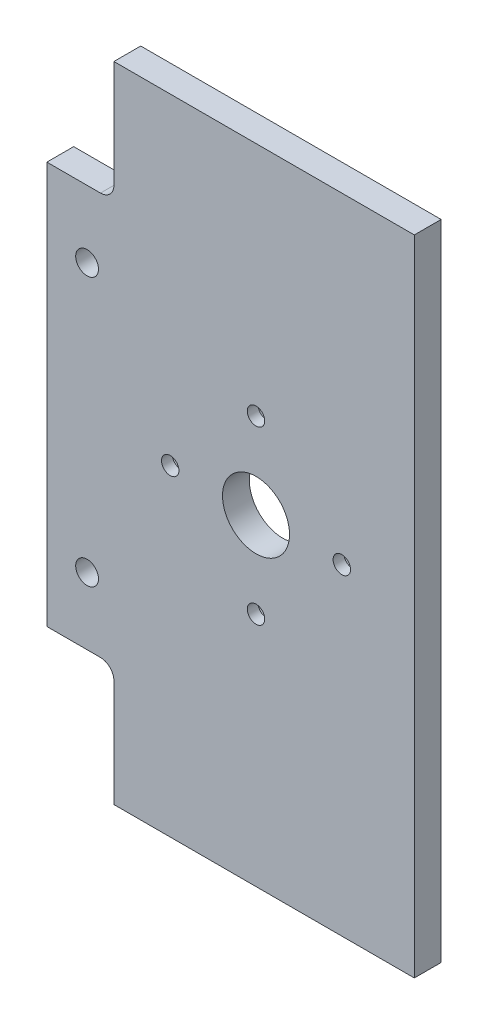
ISO-10303-21;
HEADER;
FILE_DESCRIPTION(('STEP AP214'),'2;1');
FILE_NAME('part.step','',(''),(''),'','','');
FILE_SCHEMA(('AUTOMOTIVE_DESIGN { 1 0 10303 214 1 1 1 1 }'));
ENDSEC;
DATA;
#1=APPLICATION_CONTEXT('core data for automotive mechanical design processes');
#2=APPLICATION_PROTOCOL_DEFINITION('international standard','automotive_design',2000,#1);
#3=PRODUCT_CONTEXT('',#1,'mechanical');
#4=PRODUCT('Part','Part','',(#3));
#5=PRODUCT_RELATED_PRODUCT_CATEGORY('part','',(#4));
#6=PRODUCT_DEFINITION_FORMATION('','',#4);
#7=PRODUCT_DEFINITION_CONTEXT('part definition',#1,'design');
#8=PRODUCT_DEFINITION('design','',#6,#7);
#9=PRODUCT_DEFINITION_SHAPE('','',#8);
#10=(LENGTH_UNIT() NAMED_UNIT(*) SI_UNIT(.MILLI.,.METRE.));
#11=(NAMED_UNIT(*) PLANE_ANGLE_UNIT() SI_UNIT($,.RADIAN.));
#12=(NAMED_UNIT(*) SI_UNIT($,.STERADIAN.) SOLID_ANGLE_UNIT());
#13=UNCERTAINTY_MEASURE_WITH_UNIT(LENGTH_MEASURE(1.E-05),#10,'distance_accuracy_value','');
#14=(GEOMETRIC_REPRESENTATION_CONTEXT(3) GLOBAL_UNCERTAINTY_ASSIGNED_CONTEXT((#13)) GLOBAL_UNIT_ASSIGNED_CONTEXT((#10,
#11,#12)) REPRESENTATION_CONTEXT('',''));
#15=CARTESIAN_POINT('',(0.,0.,0.));
#16=DIRECTION('',(0.,0.,1.));
#17=DIRECTION('',(1.,0.,0.));
#18=AXIS2_PLACEMENT_3D('',#15,#16,#17);
#19=CARTESIAN_POINT('',(-3.31263662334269E-13,-32.,0.));
#20=DIRECTION('',(0.,0.,1.));
#21=DIRECTION('',(1.,0.,0.));
#22=AXIS2_PLACEMENT_3D('',#19,#20,#21);
#23=CYLINDRICAL_SURFACE('',#22,3.25);
#24=CARTESIAN_POINT('',(-3.31263662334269E-13,-32.,10.));
#25=DIRECTION('',(0.,0.,1.));
#26=DIRECTION('',(0.,1.,0.));
#27=AXIS2_PLACEMENT_3D('',#24,#25,#26);
#28=CIRCLE('',#27,3.25);
#29=CARTESIAN_POINT('',(-2.97221699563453E-13,-28.75,10.));
#30=VERTEX_POINT('',#29);
#31=EDGE_CURVE('E194',#30,#30,#28,.T.);
#32=ORIENTED_EDGE('',*,*,#31,.T.);
#33=EDGE_LOOP('',(#32));
#34=FACE_BOUND('',#33,.T.);
#35=CARTESIAN_POINT('',(-3.31263662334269E-13,-32.,6.));
#36=DIRECTION('',(0.,0.,-1.));
#37=DIRECTION('',(-1.,0.,0.));
#38=AXIS2_PLACEMENT_3D('',#35,#36,#37);
#39=CIRCLE('',#38,3.25);
#40=CARTESIAN_POINT('',(-3.25000000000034,-32.,6.));
#41=VERTEX_POINT('',#40);
#42=EDGE_CURVE('E31',#41,#41,#39,.F.);
#43=ORIENTED_EDGE('',*,*,#42,.F.);
#44=EDGE_LOOP('',(#43));
#45=FACE_BOUND('',#44,.T.);
#46=ADVANCED_FACE('F27',(#34,#45),#23,.F.);
#47=CARTESIAN_POINT('',(32.,-2.19536194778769E-13,0.));
#48=DIRECTION('',(0.,0.,1.));
#49=DIRECTION('',(1.,0.,0.));
#50=AXIS2_PLACEMENT_3D('',#47,#48,#49);
#51=CYLINDRICAL_SURFACE('',#50,3.25);
#52=CARTESIAN_POINT('',(32.,-2.19536194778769E-13,10.));
#53=DIRECTION('',(0.,0.,1.));
#54=DIRECTION('',(-1.,0.,0.));
#55=AXIS2_PLACEMENT_3D('',#52,#53,#54);
#56=CIRCLE('',#55,3.25);
#57=CARTESIAN_POINT('',(28.75,-1.96841552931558E-13,10.));
#58=VERTEX_POINT('',#57);
#59=EDGE_CURVE('E217',#58,#58,#56,.T.);
#60=ORIENTED_EDGE('',*,*,#59,.T.);
#61=EDGE_LOOP('',(#60));
#62=FACE_BOUND('',#61,.T.);
#63=CARTESIAN_POINT('',(32.,-2.19536194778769E-13,6.));
#64=DIRECTION('',(0.,0.,-1.));
#65=DIRECTION('',(-1.,0.,0.));
#66=AXIS2_PLACEMENT_3D('',#63,#64,#65);
#67=CIRCLE('',#66,3.25);
#68=CARTESIAN_POINT('',(28.75,-2.19536194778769E-13,6.));
#69=VERTEX_POINT('',#68);
#70=EDGE_CURVE('E196',#69,#69,#67,.F.);
#71=ORIENTED_EDGE('',*,*,#70,.F.);
#72=EDGE_LOOP('',(#71));
#73=FACE_BOUND('',#72,.T.);
#74=ADVANCED_FACE('F252',(#62,#73),#51,.F.);
#75=CARTESIAN_POINT('',(1.07808727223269E-13,32.,0.));
#76=DIRECTION('',(0.,0.,1.));
#77=DIRECTION('',(1.,0.,0.));
#78=AXIS2_PLACEMENT_3D('',#75,#76,#77);
#79=CYLINDRICAL_SURFACE('',#78,3.25);
#80=CARTESIAN_POINT('',(1.07808727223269E-13,32.,10.));
#81=DIRECTION('',(0.,0.,1.));
#82=DIRECTION('',(0.,-1.,0.));
#83=AXIS2_PLACEMENT_3D('',#80,#81,#82);
#84=CIRCLE('',#83,3.25);
#85=CARTESIAN_POINT('',(0.,28.75,10.));
#86=VERTEX_POINT('',#85);
#87=EDGE_CURVE('E220',#86,#86,#84,.T.);
#88=ORIENTED_EDGE('',*,*,#87,.T.);
#89=EDGE_LOOP('',(#88));
#90=FACE_BOUND('',#89,.T.);
#91=CARTESIAN_POINT('',(1.07808727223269E-13,32.,6.));
#92=DIRECTION('',(0.,0.,-1.));
#93=DIRECTION('',(-1.,0.,0.));
#94=AXIS2_PLACEMENT_3D('',#91,#92,#93);
#95=CIRCLE('',#94,3.25);
#96=CARTESIAN_POINT('',(-3.2499999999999,32.,6.));
#97=VERTEX_POINT('',#96);
#98=EDGE_CURVE('E192',#97,#97,#95,.F.);
#99=ORIENTED_EDGE('',*,*,#98,.F.);
#100=EDGE_LOOP('',(#99));
#101=FACE_BOUND('',#100,.T.);
#102=ADVANCED_FACE('F259',(#90,#101),#79,.F.);
#103=CARTESIAN_POINT('',(-32.,0.,0.));
#104=DIRECTION('',(0.,0.,1.));
#105=DIRECTION('',(1.,0.,0.));
#106=AXIS2_PLACEMENT_3D('',#103,#104,#105);
#107=CYLINDRICAL_SURFACE('',#106,3.25);
#108=CARTESIAN_POINT('',(-32.,0.,10.));
#109=DIRECTION('',(0.,0.,1.));
#110=DIRECTION('',(1.,0.,0.));
#111=AXIS2_PLACEMENT_3D('',#108,#109,#110);
#112=CIRCLE('',#111,3.25);
#113=CARTESIAN_POINT('',(-28.75,0.,10.));
#114=VERTEX_POINT('',#113);
#115=EDGE_CURVE('E190',#114,#114,#112,.T.);
#116=ORIENTED_EDGE('',*,*,#115,.T.);
#117=EDGE_LOOP('',(#116));
#118=FACE_BOUND('',#117,.T.);
#119=CARTESIAN_POINT('',(-32.,0.,6.));
#120=DIRECTION('',(0.,0.,-1.));
#121=DIRECTION('',(-1.,0.,0.));
#122=AXIS2_PLACEMENT_3D('',#119,#120,#121);
#123=CIRCLE('',#122,3.25);
#124=CARTESIAN_POINT('',(-35.25,0.,6.));
#125=VERTEX_POINT('',#124);
#126=EDGE_CURVE('E187',#125,#125,#123,.F.);
#127=ORIENTED_EDGE('',*,*,#126,.F.);
#128=EDGE_LOOP('',(#127));
#129=FACE_BOUND('',#128,.T.);
#130=ADVANCED_FACE('F268',(#118,#129),#107,.F.);
#131=CARTESIAN_POINT('',(-58.,-80.,10.));
#132=DIRECTION('',(0.,0.,1.));
#133=DIRECTION('',(1.,0.,0.));
#134=AXIS2_PLACEMENT_3D('',#131,#132,#133);
#135=PLANE('',#134);
#136=CARTESIAN_POINT('',(-63.,-50.,10.));
#137=DIRECTION('',(0.,0.,1.));
#138=DIRECTION('',(1.,0.,0.));
#139=AXIS2_PLACEMENT_3D('',#136,#137,#138);
#140=CIRCLE('',#139,4.25000000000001);
#141=CARTESIAN_POINT('',(-58.75,-50.,10.));
#142=VERTEX_POINT('',#141);
#143=EDGE_CURVE('E402',#142,#142,#140,.T.);
#144=ORIENTED_EDGE('',*,*,#143,.F.);
#145=EDGE_LOOP('',(#144));
#146=FACE_BOUND('',#145,.T.);
#147=CARTESIAN_POINT('',(-63.,50.,10.));
#148=DIRECTION('',(0.,0.,1.));
#149=DIRECTION('',(1.,0.,0.));
#150=AXIS2_PLACEMENT_3D('',#147,#148,#149);
#151=CIRCLE('',#150,4.25000000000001);
#152=CARTESIAN_POINT('',(-58.75,50.,10.));
#153=VERTEX_POINT('',#152);
#154=EDGE_CURVE('E404',#153,#153,#151,.T.);
#155=ORIENTED_EDGE('',*,*,#154,.F.);
#156=EDGE_LOOP('',(#155));
#157=FACE_BOUND('',#156,.T.);
#158=ORIENTED_EDGE('',*,*,#31,.F.);
#159=EDGE_LOOP('',(#158));
#160=FACE_BOUND('',#159,.T.);
#161=ORIENTED_EDGE('',*,*,#59,.F.);
#162=EDGE_LOOP('',(#161));
#163=FACE_BOUND('',#162,.T.);
#164=ORIENTED_EDGE('',*,*,#87,.F.);
#165=EDGE_LOOP('',(#164));
#166=FACE_BOUND('',#165,.T.);
#167=ORIENTED_EDGE('',*,*,#115,.F.);
#168=EDGE_LOOP('',(#167));
#169=FACE_BOUND('',#168,.T.);
#170=DIRECTION('',(0.,-1.,0.));
#171=VECTOR('',#170,1.);
#172=CARTESIAN_POINT('',(-53.,-120.,10.));
#173=LINE('',#172,#171);
#174=CARTESIAN_POINT('',(-53.,-80.,10.));
#175=VERTEX_POINT('',#174);
#176=CARTESIAN_POINT('',(-53.,-120.,10.));
#177=VERTEX_POINT('',#176);
#178=EDGE_CURVE('E147',#175,#177,#173,.T.);
#179=ORIENTED_EDGE('',*,*,#178,.T.);
#180=DIRECTION('',(1.,0.,0.));
#181=VECTOR('',#180,1.);
#182=CARTESIAN_POINT('',(-53.,-120.,10.));
#183=LINE('',#182,#181);
#184=CARTESIAN_POINT('',(59.0364270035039,-120.,10.));
#185=VERTEX_POINT('',#184);
#186=EDGE_CURVE('E120',#177,#185,#183,.T.);
#187=ORIENTED_EDGE('',*,*,#186,.T.);
#188=DIRECTION('',(0.,1.,0.));
#189=VECTOR('',#188,1.);
#190=CARTESIAN_POINT('',(59.0364270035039,120.,10.));
#191=LINE('',#190,#189);
#192=CARTESIAN_POINT('',(59.0364270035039,120.,10.));
#193=VERTEX_POINT('',#192);
#194=EDGE_CURVE('E150',#185,#193,#191,.T.);
#195=ORIENTED_EDGE('',*,*,#194,.T.);
#196=DIRECTION('',(-1.,0.,0.));
#197=VECTOR('',#196,1.);
#198=CARTESIAN_POINT('',(-53.,120.,10.));
#199=LINE('',#198,#197);
#200=CARTESIAN_POINT('',(-53.,120.,10.));
#201=VERTEX_POINT('',#200);
#202=EDGE_CURVE('E152',#193,#201,#199,.T.);
#203=ORIENTED_EDGE('',*,*,#202,.T.);
#204=DIRECTION('',(0.,-1.,0.));
#205=VECTOR('',#204,1.);
#206=CARTESIAN_POINT('',(-53.,120.,10.));
#207=LINE('',#206,#205);
#208=CARTESIAN_POINT('',(-53.,80.,10.));
#209=VERTEX_POINT('',#208);
#210=EDGE_CURVE('E154',#201,#209,#207,.T.);
#211=ORIENTED_EDGE('',*,*,#210,.T.);
#212=CARTESIAN_POINT('',(-58.,80.,10.));
#213=DIRECTION('',(0.,0.,-1.));
#214=DIRECTION('',(-1.,0.,0.));
#215=AXIS2_PLACEMENT_3D('',#212,#213,#214);
#216=CIRCLE('',#215,5.);
#217=CARTESIAN_POINT('',(-58.,75.,10.));
#218=VERTEX_POINT('',#217);
#219=EDGE_CURVE('E156',#209,#218,#216,.T.);
#220=ORIENTED_EDGE('',*,*,#219,.T.);
#221=DIRECTION('',(-1.,0.,0.));
#222=VECTOR('',#221,1.);
#223=CARTESIAN_POINT('',(-78.,75.,10.));
#224=LINE('',#223,#222);
#225=CARTESIAN_POINT('',(-78.,75.,10.));
#226=VERTEX_POINT('',#225);
#227=EDGE_CURVE('E158',#218,#226,#224,.T.);
#228=ORIENTED_EDGE('',*,*,#227,.T.);
#229=DIRECTION('',(0.,-1.,0.));
#230=VECTOR('',#229,1.);
#231=CARTESIAN_POINT('',(-78.,75.,10.));
#232=LINE('',#231,#230);
#233=CARTESIAN_POINT('',(-78.,-75.,10.));
#234=VERTEX_POINT('',#233);
#235=EDGE_CURVE('E160',#226,#234,#232,.T.);
#236=ORIENTED_EDGE('',*,*,#235,.T.);
#237=DIRECTION('',(1.,0.,0.));
#238=VECTOR('',#237,1.);
#239=CARTESIAN_POINT('',(-78.,-75.,10.));
#240=LINE('',#239,#238);
#241=CARTESIAN_POINT('',(-58.,-75.,10.));
#242=VERTEX_POINT('',#241);
#243=EDGE_CURVE('E49',#234,#242,#240,.T.);
#244=ORIENTED_EDGE('',*,*,#243,.T.);
#245=CARTESIAN_POINT('',(-58.,-80.,10.));
#246=DIRECTION('',(0.,0.,-1.));
#247=DIRECTION('',(1.,0.,0.));
#248=AXIS2_PLACEMENT_3D('',#245,#246,#247);
#249=CIRCLE('',#248,5.);
#250=EDGE_CURVE('E44',#242,#175,#249,.T.);
#251=ORIENTED_EDGE('',*,*,#250,.T.);
#252=EDGE_LOOP('',(#179,#187,#195,#203,#211,#220,#228,#236,#244,#251));
#253=FACE_BOUND('',#252,.T.);
#254=CARTESIAN_POINT('',(0.,0.,10.));
#255=DIRECTION('',(0.,0.,1.));
#256=DIRECTION('',(1.,0.,0.));
#257=AXIS2_PLACEMENT_3D('',#254,#255,#256);
#258=CIRCLE('',#257,12.5);
#259=CARTESIAN_POINT('',(12.5,0.,10.));
#260=VERTEX_POINT('',#259);
#261=EDGE_CURVE('E125',#260,#260,#258,.T.);
#262=ORIENTED_EDGE('',*,*,#261,.F.);
#263=EDGE_LOOP('',(#262));
#264=FACE_BOUND('',#263,.T.);
#265=ADVANCED_FACE('F273',(#146,#157,#160,#163,#166,#169,#253,#264),#135,.T.);
#266=CARTESIAN_POINT('',(-58.,-80.,0.));
#267=DIRECTION('',(0.,0.,1.));
#268=DIRECTION('',(1.,0.,0.));
#269=AXIS2_PLACEMENT_3D('',#266,#267,#268);
#270=PLANE('',#269);
#271=CARTESIAN_POINT('',(-63.,-50.,0.));
#272=DIRECTION('',(0.,0.,1.));
#273=DIRECTION('',(1.,0.,0.));
#274=AXIS2_PLACEMENT_3D('',#271,#272,#273);
#275=CIRCLE('',#274,4.25000000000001);
#276=CARTESIAN_POINT('',(-58.75,-50.,0.));
#277=VERTEX_POINT('',#276);
#278=EDGE_CURVE('E347',#277,#277,#275,.T.);
#279=ORIENTED_EDGE('',*,*,#278,.T.);
#280=EDGE_LOOP('',(#279));
#281=FACE_BOUND('',#280,.T.);
#282=CARTESIAN_POINT('',(-63.,50.,0.));
#283=DIRECTION('',(0.,0.,1.));
#284=DIRECTION('',(1.,0.,0.));
#285=AXIS2_PLACEMENT_3D('',#282,#283,#284);
#286=CIRCLE('',#285,4.25000000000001);
#287=CARTESIAN_POINT('',(-58.75,50.,0.));
#288=VERTEX_POINT('',#287);
#289=EDGE_CURVE('E351',#288,#288,#286,.T.);
#290=ORIENTED_EDGE('',*,*,#289,.T.);
#291=EDGE_LOOP('',(#290));
#292=FACE_BOUND('',#291,.T.);
#293=CARTESIAN_POINT('',(-3.31263662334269E-13,-32.,0.));
#294=DIRECTION('',(0.,0.,-1.));
#295=DIRECTION('',(0.,-1.,0.));
#296=AXIS2_PLACEMENT_3D('',#293,#294,#295);
#297=CIRCLE('',#296,6.50000000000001);
#298=CARTESIAN_POINT('',(-3.99347587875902E-13,-38.5,0.));
#299=VERTEX_POINT('',#298);
#300=EDGE_CURVE('E355',#299,#299,#297,.T.);
#301=ORIENTED_EDGE('',*,*,#300,.F.);
#302=EDGE_LOOP('',(#301));
#303=FACE_BOUND('',#302,.T.);
#304=CARTESIAN_POINT('',(32.,-2.19536194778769E-13,0.));
#305=DIRECTION('',(0.,0.,-1.));
#306=DIRECTION('',(1.,0.,0.));
#307=AXIS2_PLACEMENT_3D('',#304,#305,#306);
#308=CIRCLE('',#307,6.50000000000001);
#309=CARTESIAN_POINT('',(38.5,-2.64925478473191E-13,0.));
#310=VERTEX_POINT('',#309);
#311=EDGE_CURVE('E205',#310,#310,#308,.T.);
#312=ORIENTED_EDGE('',*,*,#311,.F.);
#313=EDGE_LOOP('',(#312));
#314=FACE_BOUND('',#313,.T.);
#315=CARTESIAN_POINT('',(1.07808727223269E-13,32.,0.));
#316=DIRECTION('',(0.,0.,-1.));
#317=DIRECTION('',(0.,1.,0.));
#318=AXIS2_PLACEMENT_3D('',#315,#316,#317);
#319=CIRCLE('',#318,6.50000000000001);
#320=CARTESIAN_POINT('',(1.3050336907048E-13,38.5,0.));
#321=VERTEX_POINT('',#320);
#322=EDGE_CURVE('E198',#321,#321,#319,.T.);
#323=ORIENTED_EDGE('',*,*,#322,.F.);
#324=EDGE_LOOP('',(#323));
#325=FACE_BOUND('',#324,.T.);
#326=CARTESIAN_POINT('',(-32.,0.,0.));
#327=DIRECTION('',(0.,0.,-1.));
#328=DIRECTION('',(-1.,0.,0.));
#329=AXIS2_PLACEMENT_3D('',#326,#327,#328);
#330=CIRCLE('',#329,6.50000000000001);
#331=CARTESIAN_POINT('',(-38.5,0.,0.));
#332=VERTEX_POINT('',#331);
#333=EDGE_CURVE('E223',#332,#332,#330,.T.);
#334=ORIENTED_EDGE('',*,*,#333,.F.);
#335=EDGE_LOOP('',(#334));
#336=FACE_BOUND('',#335,.T.);
#337=DIRECTION('',(0.,-1.,0.));
#338=VECTOR('',#337,1.);
#339=CARTESIAN_POINT('',(-53.,-120.,0.));
#340=LINE('',#339,#338);
#341=CARTESIAN_POINT('',(-53.,-80.,0.));
#342=VERTEX_POINT('',#341);
#343=CARTESIAN_POINT('',(-53.,-120.,0.));
#344=VERTEX_POINT('',#343);
#345=EDGE_CURVE('E111',#342,#344,#340,.T.);
#346=ORIENTED_EDGE('',*,*,#345,.F.);
#347=CARTESIAN_POINT('',(-58.,-80.,0.));
#348=DIRECTION('',(0.,0.,-1.));
#349=DIRECTION('',(1.,0.,0.));
#350=AXIS2_PLACEMENT_3D('',#347,#348,#349);
#351=CIRCLE('',#350,5.);
#352=CARTESIAN_POINT('',(-58.,-75.,0.));
#353=VERTEX_POINT('',#352);
#354=EDGE_CURVE('E145',#353,#342,#351,.T.);
#355=ORIENTED_EDGE('',*,*,#354,.F.);
#356=DIRECTION('',(1.,0.,0.));
#357=VECTOR('',#356,1.);
#358=CARTESIAN_POINT('',(-78.,-75.,0.));
#359=LINE('',#358,#357);
#360=CARTESIAN_POINT('',(-78.,-75.,0.));
#361=VERTEX_POINT('',#360);
#362=EDGE_CURVE('E143',#361,#353,#359,.T.);
#363=ORIENTED_EDGE('',*,*,#362,.F.);
#364=DIRECTION('',(0.,-1.,0.));
#365=VECTOR('',#364,1.);
#366=CARTESIAN_POINT('',(-78.,75.,0.));
#367=LINE('',#366,#365);
#368=CARTESIAN_POINT('',(-78.,75.,0.));
#369=VERTEX_POINT('',#368);
#370=EDGE_CURVE('E141',#369,#361,#367,.T.);
#371=ORIENTED_EDGE('',*,*,#370,.F.);
#372=DIRECTION('',(-1.,0.,0.));
#373=VECTOR('',#372,1.);
#374=CARTESIAN_POINT('',(-78.,75.,0.));
#375=LINE('',#374,#373);
#376=CARTESIAN_POINT('',(-58.,75.,0.));
#377=VERTEX_POINT('',#376);
#378=EDGE_CURVE('E139',#377,#369,#375,.T.);
#379=ORIENTED_EDGE('',*,*,#378,.F.);
#380=CARTESIAN_POINT('',(-58.,80.,0.));
#381=DIRECTION('',(0.,0.,-1.));
#382=DIRECTION('',(-1.,0.,0.));
#383=AXIS2_PLACEMENT_3D('',#380,#381,#382);
#384=CIRCLE('',#383,5.);
#385=CARTESIAN_POINT('',(-53.,80.,0.));
#386=VERTEX_POINT('',#385);
#387=EDGE_CURVE('E137',#386,#377,#384,.T.);
#388=ORIENTED_EDGE('',*,*,#387,.F.);
#389=DIRECTION('',(0.,-1.,0.));
#390=VECTOR('',#389,1.);
#391=CARTESIAN_POINT('',(-53.,120.,0.));
#392=LINE('',#391,#390);
#393=CARTESIAN_POINT('',(-53.,120.,0.));
#394=VERTEX_POINT('',#393);
#395=EDGE_CURVE('E135',#394,#386,#392,.T.);
#396=ORIENTED_EDGE('',*,*,#395,.F.);
#397=DIRECTION('',(-1.,0.,0.));
#398=VECTOR('',#397,1.);
#399=CARTESIAN_POINT('',(-53.,120.,0.));
#400=LINE('',#399,#398);
#401=CARTESIAN_POINT('',(59.0364270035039,120.,0.));
#402=VERTEX_POINT('',#401);
#403=EDGE_CURVE('E133',#402,#394,#400,.T.);
#404=ORIENTED_EDGE('',*,*,#403,.F.);
#405=DIRECTION('',(0.,1.,0.));
#406=VECTOR('',#405,1.);
#407=CARTESIAN_POINT('',(59.0364270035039,120.,0.));
#408=LINE('',#407,#406);
#409=CARTESIAN_POINT('',(59.0364270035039,-120.,0.));
#410=VERTEX_POINT('',#409);
#411=EDGE_CURVE('E113',#410,#402,#408,.T.);
#412=ORIENTED_EDGE('',*,*,#411,.F.);
#413=DIRECTION('',(1.,0.,0.));
#414=VECTOR('',#413,1.);
#415=CARTESIAN_POINT('',(-53.,-120.,0.));
#416=LINE('',#415,#414);
#417=EDGE_CURVE('E106',#344,#410,#416,.T.);
#418=ORIENTED_EDGE('',*,*,#417,.F.);
#419=EDGE_LOOP('',(#346,#355,#363,#371,#379,#388,#396,#404,#412,#418));
#420=FACE_BOUND('',#419,.T.);
#421=CARTESIAN_POINT('',(0.,0.,0.));
#422=DIRECTION('',(0.,0.,1.));
#423=DIRECTION('',(1.,0.,0.));
#424=AXIS2_PLACEMENT_3D('',#421,#422,#423);
#425=CIRCLE('',#424,12.5);
#426=CARTESIAN_POINT('',(12.5,0.,0.));
#427=VERTEX_POINT('',#426);
#428=EDGE_CURVE('E128',#427,#427,#425,.T.);
#429=ORIENTED_EDGE('',*,*,#428,.T.);
#430=EDGE_LOOP('',(#429));
#431=FACE_BOUND('',#430,.T.);
#432=ADVANCED_FACE('F107',(#281,#292,#303,#314,#325,#336,#420,#431),#270,.F.);
#433=CARTESIAN_POINT('',(-53.,-120.,10.));
#434=DIRECTION('',(1.,0.,0.));
#435=DIRECTION('',(0.,1.,0.));
#436=AXIS2_PLACEMENT_3D('',#433,#434,#435);
#437=PLANE('',#436);
#438=ORIENTED_EDGE('',*,*,#345,.T.);
#439=DIRECTION('',(0.,0.,-1.));
#440=VECTOR('',#439,1.);
#441=CARTESIAN_POINT('',(-53.,-120.,10.));
#442=LINE('',#441,#440);
#443=EDGE_CURVE('E11',#177,#344,#442,.T.);
#444=ORIENTED_EDGE('',*,*,#443,.F.);
#445=ORIENTED_EDGE('',*,*,#178,.F.);
#446=DIRECTION('',(0.,0.,-1.));
#447=VECTOR('',#446,1.);
#448=CARTESIAN_POINT('',(-53.,-80.,10.));
#449=LINE('',#448,#447);
#450=EDGE_CURVE('E124',#175,#342,#449,.T.);
#451=ORIENTED_EDGE('',*,*,#450,.T.);
#452=EDGE_LOOP('',(#438,#444,#445,#451));
#453=FACE_BOUND('',#452,.T.);
#454=ADVANCED_FACE('F29',(#453),#437,.F.);
#455=CARTESIAN_POINT('',(-53.,-120.,10.));
#456=DIRECTION('',(0.,1.,0.));
#457=DIRECTION('',(0.,0.,1.));
#458=AXIS2_PLACEMENT_3D('',#455,#456,#457);
#459=PLANE('',#458);
#460=ORIENTED_EDGE('',*,*,#417,.T.);
#461=DIRECTION('',(0.,0.,-1.));
#462=VECTOR('',#461,1.);
#463=CARTESIAN_POINT('',(59.0364270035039,-120.,10.));
#464=LINE('',#463,#462);
#465=EDGE_CURVE('E36',#185,#410,#464,.T.);
#466=ORIENTED_EDGE('',*,*,#465,.F.);
#467=ORIENTED_EDGE('',*,*,#186,.F.);
#468=ORIENTED_EDGE('',*,*,#443,.T.);
#469=EDGE_LOOP('',(#460,#466,#467,#468));
#470=FACE_BOUND('',#469,.T.);
#471=ADVANCED_FACE('F119',(#470),#459,.F.);
#472=CARTESIAN_POINT('',(59.0364270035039,120.,10.));
#473=DIRECTION('',(-1.,0.,0.));
#474=DIRECTION('',(0.,0.,1.));
#475=AXIS2_PLACEMENT_3D('',#472,#473,#474);
#476=PLANE('',#475);
#477=ORIENTED_EDGE('',*,*,#411,.T.);
#478=DIRECTION('',(0.,0.,-1.));
#479=VECTOR('',#478,1.);
#480=CARTESIAN_POINT('',(59.0364270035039,120.,10.));
#481=LINE('',#480,#479);
#482=EDGE_CURVE('E183',#193,#402,#481,.T.);
#483=ORIENTED_EDGE('',*,*,#482,.F.);
#484=ORIENTED_EDGE('',*,*,#194,.F.);
#485=ORIENTED_EDGE('',*,*,#465,.T.);
#486=EDGE_LOOP('',(#477,#483,#484,#485));
#487=FACE_BOUND('',#486,.T.);
#488=ADVANCED_FACE('F290',(#487),#476,.F.);
#489=CARTESIAN_POINT('',(-53.,120.,10.));
#490=DIRECTION('',(0.,-1.,0.));
#491=DIRECTION('',(0.,0.,-1.));
#492=AXIS2_PLACEMENT_3D('',#489,#490,#491);
#493=PLANE('',#492);
#494=ORIENTED_EDGE('',*,*,#403,.T.);
#495=DIRECTION('',(0.,0.,-1.));
#496=VECTOR('',#495,1.);
#497=CARTESIAN_POINT('',(-53.,120.,10.));
#498=LINE('',#497,#496);
#499=EDGE_CURVE('E180',#201,#394,#498,.T.);
#500=ORIENTED_EDGE('',*,*,#499,.F.);
#501=ORIENTED_EDGE('',*,*,#202,.F.);
#502=ORIENTED_EDGE('',*,*,#482,.T.);
#503=EDGE_LOOP('',(#494,#500,#501,#502));
#504=FACE_BOUND('',#503,.T.);
#505=ADVANCED_FACE('F294',(#504),#493,.F.);
#506=CARTESIAN_POINT('',(-53.,120.,10.));
#507=DIRECTION('',(1.,0.,0.));
#508=DIRECTION('',(0.,1.,0.));
#509=AXIS2_PLACEMENT_3D('',#506,#507,#508);
#510=PLANE('',#509);
#511=ORIENTED_EDGE('',*,*,#395,.T.);
#512=DIRECTION('',(0.,0.,-1.));
#513=VECTOR('',#512,1.);
#514=CARTESIAN_POINT('',(-53.,80.,10.));
#515=LINE('',#514,#513);
#516=EDGE_CURVE('E177',#209,#386,#515,.T.);
#517=ORIENTED_EDGE('',*,*,#516,.F.);
#518=ORIENTED_EDGE('',*,*,#210,.F.);
#519=ORIENTED_EDGE('',*,*,#499,.T.);
#520=EDGE_LOOP('',(#511,#517,#518,#519));
#521=FACE_BOUND('',#520,.T.);
#522=ADVANCED_FACE('F300',(#521),#510,.F.);
#523=CARTESIAN_POINT('',(-58.,80.,10.));
#524=DIRECTION('',(0.,0.,-1.));
#525=DIRECTION('',(-1.,0.,0.));
#526=AXIS2_PLACEMENT_3D('',#523,#524,#525);
#527=CYLINDRICAL_SURFACE('',#526,5.);
#528=ORIENTED_EDGE('',*,*,#387,.T.);
#529=DIRECTION('',(0.,0.,-1.));
#530=VECTOR('',#529,1.);
#531=CARTESIAN_POINT('',(-58.,75.,10.));
#532=LINE('',#531,#530);
#533=EDGE_CURVE('E174',#218,#377,#532,.T.);
#534=ORIENTED_EDGE('',*,*,#533,.F.);
#535=ORIENTED_EDGE('',*,*,#219,.F.);
#536=ORIENTED_EDGE('',*,*,#516,.T.);
#537=EDGE_LOOP('',(#528,#534,#535,#536));
#538=FACE_BOUND('',#537,.T.);
#539=ADVANCED_FACE('F304',(#538),#527,.F.);
#540=CARTESIAN_POINT('',(-78.,75.,10.));
#541=DIRECTION('',(0.,-1.,0.));
#542=DIRECTION('',(0.,0.,-1.));
#543=AXIS2_PLACEMENT_3D('',#540,#541,#542);
#544=PLANE('',#543);
#545=ORIENTED_EDGE('',*,*,#378,.T.);
#546=DIRECTION('',(0.,0.,-1.));
#547=VECTOR('',#546,1.);
#548=CARTESIAN_POINT('',(-78.,75.,10.));
#549=LINE('',#548,#547);
#550=EDGE_CURVE('E171',#226,#369,#549,.T.);
#551=ORIENTED_EDGE('',*,*,#550,.F.);
#552=ORIENTED_EDGE('',*,*,#227,.F.);
#553=ORIENTED_EDGE('',*,*,#533,.T.);
#554=EDGE_LOOP('',(#545,#551,#552,#553));
#555=FACE_BOUND('',#554,.T.);
#556=ADVANCED_FACE('F309',(#555),#544,.F.);
#557=CARTESIAN_POINT('',(-78.,75.,10.));
#558=DIRECTION('',(1.,0.,0.));
#559=DIRECTION('',(0.,0.,-1.));
#560=AXIS2_PLACEMENT_3D('',#557,#558,#559);
#561=PLANE('',#560);
#562=ORIENTED_EDGE('',*,*,#370,.T.);
#563=DIRECTION('',(0.,0.,-1.));
#564=VECTOR('',#563,1.);
#565=CARTESIAN_POINT('',(-78.,-75.,10.));
#566=LINE('',#565,#564);
#567=EDGE_CURVE('E168',#234,#361,#566,.T.);
#568=ORIENTED_EDGE('',*,*,#567,.F.);
#569=ORIENTED_EDGE('',*,*,#235,.F.);
#570=ORIENTED_EDGE('',*,*,#550,.T.);
#571=EDGE_LOOP('',(#562,#568,#569,#570));
#572=FACE_BOUND('',#571,.T.);
#573=ADVANCED_FACE('F313',(#572),#561,.F.);
#574=CARTESIAN_POINT('',(-78.,-75.,10.));
#575=DIRECTION('',(0.,1.,0.));
#576=DIRECTION('',(0.,0.,1.));
#577=AXIS2_PLACEMENT_3D('',#574,#575,#576);
#578=PLANE('',#577);
#579=ORIENTED_EDGE('',*,*,#362,.T.);
#580=DIRECTION('',(0.,0.,-1.));
#581=VECTOR('',#580,1.);
#582=CARTESIAN_POINT('',(-58.,-75.,10.));
#583=LINE('',#582,#581);
#584=EDGE_CURVE('E165',#242,#353,#583,.T.);
#585=ORIENTED_EDGE('',*,*,#584,.F.);
#586=ORIENTED_EDGE('',*,*,#243,.F.);
#587=ORIENTED_EDGE('',*,*,#567,.T.);
#588=EDGE_LOOP('',(#579,#585,#586,#587));
#589=FACE_BOUND('',#588,.T.);
#590=ADVANCED_FACE('F246',(#589),#578,.F.);
#591=CARTESIAN_POINT('',(-58.,-80.,10.));
#592=DIRECTION('',(0.,0.,-1.));
#593=DIRECTION('',(-1.,0.,0.));
#594=AXIS2_PLACEMENT_3D('',#591,#592,#593);
#595=CYLINDRICAL_SURFACE('',#594,5.);
#596=ORIENTED_EDGE('',*,*,#354,.T.);
#597=ORIENTED_EDGE('',*,*,#450,.F.);
#598=ORIENTED_EDGE('',*,*,#250,.F.);
#599=ORIENTED_EDGE('',*,*,#584,.T.);
#600=EDGE_LOOP('',(#596,#597,#598,#599));
#601=FACE_BOUND('',#600,.T.);
#602=ADVANCED_FACE('F235',(#601),#595,.F.);
#603=CARTESIAN_POINT('',(0.,0.,10.));
#604=DIRECTION('',(0.,0.,-1.));
#605=DIRECTION('',(-1.,0.,0.));
#606=AXIS2_PLACEMENT_3D('',#603,#604,#605);
#607=CYLINDRICAL_SURFACE('',#606,12.5);
#608=ORIENTED_EDGE('',*,*,#261,.T.);
#609=EDGE_LOOP('',(#608));
#610=FACE_BOUND('',#609,.T.);
#611=ORIENTED_EDGE('',*,*,#428,.F.);
#612=EDGE_LOOP('',(#611));
#613=FACE_BOUND('',#612,.T.);
#614=ADVANCED_FACE('F232',(#610,#613),#607,.F.);
#615=CARTESIAN_POINT('',(-32.,0.,6.));
#616=DIRECTION('',(0.,0.,-1.));
#617=DIRECTION('',(-1.,0.,0.));
#618=AXIS2_PLACEMENT_3D('',#615,#616,#617);
#619=PLANE('',#618);
#620=CARTESIAN_POINT('',(-32.,0.,6.));
#621=DIRECTION('',(0.,0.,-1.));
#622=DIRECTION('',(-1.,0.,0.));
#623=AXIS2_PLACEMENT_3D('',#620,#621,#622);
#624=CIRCLE('',#623,6.50000000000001);
#625=CARTESIAN_POINT('',(-38.5,0.,6.));
#626=VERTEX_POINT('',#625);
#627=EDGE_CURVE('E191',#626,#626,#624,.T.);
#628=ORIENTED_EDGE('',*,*,#627,.T.);
#629=EDGE_LOOP('',(#628));
#630=FACE_BOUND('',#629,.T.);
#631=ORIENTED_EDGE('',*,*,#126,.T.);
#632=EDGE_LOOP('',(#631));
#633=FACE_BOUND('',#632,.T.);
#634=ADVANCED_FACE('F234',(#630,#633),#619,.T.);
#635=CARTESIAN_POINT('',(-32.,0.,6.));
#636=DIRECTION('',(0.,0.,-1.));
#637=DIRECTION('',(-1.,0.,0.));
#638=AXIS2_PLACEMENT_3D('',#635,#636,#637);
#639=CYLINDRICAL_SURFACE('',#638,6.50000000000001);
#640=ORIENTED_EDGE('',*,*,#627,.F.);
#641=EDGE_LOOP('',(#640));
#642=FACE_BOUND('',#641,.T.);
#643=ORIENTED_EDGE('',*,*,#333,.T.);
#644=EDGE_LOOP('',(#643));
#645=FACE_BOUND('',#644,.T.);
#646=ADVANCED_FACE('F243',(#642,#645),#639,.F.);
#647=CARTESIAN_POINT('',(1.07808727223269E-13,32.,6.));
#648=DIRECTION('',(0.,0.,-1.));
#649=DIRECTION('',(0.,1.,0.));
#650=AXIS2_PLACEMENT_3D('',#647,#648,#649);
#651=PLANE('',#650);
#652=CARTESIAN_POINT('',(1.07808727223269E-13,32.,6.));
#653=DIRECTION('',(0.,0.,-1.));
#654=DIRECTION('',(0.,1.,0.));
#655=AXIS2_PLACEMENT_3D('',#652,#653,#654);
#656=CIRCLE('',#655,6.50000000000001);
#657=CARTESIAN_POINT('',(1.3050336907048E-13,38.5,6.));
#658=VERTEX_POINT('',#657);
#659=EDGE_CURVE('E195',#658,#658,#656,.T.);
#660=ORIENTED_EDGE('',*,*,#659,.T.);
#661=EDGE_LOOP('',(#660));
#662=FACE_BOUND('',#661,.T.);
#663=ORIENTED_EDGE('',*,*,#98,.T.);
#664=EDGE_LOOP('',(#663));
#665=FACE_BOUND('',#664,.T.);
#666=ADVANCED_FACE('F271',(#662,#665),#651,.T.);
#667=CARTESIAN_POINT('',(1.07808727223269E-13,32.,6.));
#668=DIRECTION('',(0.,0.,-1.));
#669=DIRECTION('',(-1.,0.,0.));
#670=AXIS2_PLACEMENT_3D('',#667,#668,#669);
#671=CYLINDRICAL_SURFACE('',#670,6.50000000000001);
#672=ORIENTED_EDGE('',*,*,#659,.F.);
#673=EDGE_LOOP('',(#672));
#674=FACE_BOUND('',#673,.T.);
#675=ORIENTED_EDGE('',*,*,#322,.T.);
#676=EDGE_LOOP('',(#675));
#677=FACE_BOUND('',#676,.T.);
#678=ADVANCED_FACE('F264',(#674,#677),#671,.F.);
#679=CARTESIAN_POINT('',(32.,-2.19536194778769E-13,6.));
#680=DIRECTION('',(0.,0.,-1.));
#681=DIRECTION('',(1.,0.,0.));
#682=AXIS2_PLACEMENT_3D('',#679,#680,#681);
#683=PLANE('',#682);
#684=CARTESIAN_POINT('',(32.,-2.19536194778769E-13,6.));
#685=DIRECTION('',(0.,0.,-1.));
#686=DIRECTION('',(1.,0.,0.));
#687=AXIS2_PLACEMENT_3D('',#684,#685,#686);
#688=CIRCLE('',#687,6.50000000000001);
#689=CARTESIAN_POINT('',(38.5,-2.64925478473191E-13,6.));
#690=VERTEX_POINT('',#689);
#691=EDGE_CURVE('E199',#690,#690,#688,.T.);
#692=ORIENTED_EDGE('',*,*,#691,.T.);
#693=EDGE_LOOP('',(#692));
#694=FACE_BOUND('',#693,.T.);
#695=ORIENTED_EDGE('',*,*,#70,.T.);
#696=EDGE_LOOP('',(#695));
#697=FACE_BOUND('',#696,.T.);
#698=ADVANCED_FACE('F364',(#694,#697),#683,.T.);
#699=CARTESIAN_POINT('',(32.,-2.19536194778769E-13,6.));
#700=DIRECTION('',(0.,0.,-1.));
#701=DIRECTION('',(-1.,0.,0.));
#702=AXIS2_PLACEMENT_3D('',#699,#700,#701);
#703=CYLINDRICAL_SURFACE('',#702,6.50000000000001);
#704=ORIENTED_EDGE('',*,*,#691,.F.);
#705=EDGE_LOOP('',(#704));
#706=FACE_BOUND('',#705,.T.);
#707=ORIENTED_EDGE('',*,*,#311,.T.);
#708=EDGE_LOOP('',(#707));
#709=FACE_BOUND('',#708,.T.);
#710=ADVANCED_FACE('F370',(#706,#709),#703,.F.);
#711=CARTESIAN_POINT('',(-3.31263662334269E-13,-32.,6.));
#712=DIRECTION('',(0.,0.,-1.));
#713=DIRECTION('',(0.,-1.,0.));
#714=AXIS2_PLACEMENT_3D('',#711,#712,#713);
#715=PLANE('',#714);
#716=CARTESIAN_POINT('',(-3.31263662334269E-13,-32.,6.));
#717=DIRECTION('',(0.,0.,-1.));
#718=DIRECTION('',(0.,-1.,0.));
#719=AXIS2_PLACEMENT_3D('',#716,#717,#718);
#720=CIRCLE('',#719,6.50000000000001);
#721=CARTESIAN_POINT('',(-3.99347587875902E-13,-38.5,6.));
#722=VERTEX_POINT('',#721);
#723=EDGE_CURVE('E410',#722,#722,#720,.T.);
#724=ORIENTED_EDGE('',*,*,#723,.T.);
#725=EDGE_LOOP('',(#724));
#726=FACE_BOUND('',#725,.T.);
#727=ORIENTED_EDGE('',*,*,#42,.T.);
#728=EDGE_LOOP('',(#727));
#729=FACE_BOUND('',#728,.T.);
#730=ADVANCED_FACE('F381',(#726,#729),#715,.T.);
#731=CARTESIAN_POINT('',(-3.31263662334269E-13,-32.,6.));
#732=DIRECTION('',(0.,0.,-1.));
#733=DIRECTION('',(-1.,0.,0.));
#734=AXIS2_PLACEMENT_3D('',#731,#732,#733);
#735=CYLINDRICAL_SURFACE('',#734,6.50000000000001);
#736=ORIENTED_EDGE('',*,*,#723,.F.);
#737=EDGE_LOOP('',(#736));
#738=FACE_BOUND('',#737,.T.);
#739=ORIENTED_EDGE('',*,*,#300,.T.);
#740=EDGE_LOOP('',(#739));
#741=FACE_BOUND('',#740,.T.);
#742=ADVANCED_FACE('F384',(#738,#741),#735,.F.);
#743=CARTESIAN_POINT('',(-63.,50.,0.));
#744=DIRECTION('',(0.,0.,1.));
#745=DIRECTION('',(1.,0.,0.));
#746=AXIS2_PLACEMENT_3D('',#743,#744,#745);
#747=CYLINDRICAL_SURFACE('',#746,4.25000000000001);
#748=ORIENTED_EDGE('',*,*,#289,.F.);
#749=EDGE_LOOP('',(#748));
#750=FACE_BOUND('',#749,.T.);
#751=ORIENTED_EDGE('',*,*,#154,.T.);
#752=EDGE_LOOP('',(#751));
#753=FACE_BOUND('',#752,.T.);
#754=ADVANCED_FACE('F387',(#750,#753),#747,.F.);
#755=CARTESIAN_POINT('',(-63.,-50.,0.));
#756=DIRECTION('',(0.,0.,1.));
#757=DIRECTION('',(1.,0.,0.));
#758=AXIS2_PLACEMENT_3D('',#755,#756,#757);
#759=CYLINDRICAL_SURFACE('',#758,4.25000000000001);
#760=ORIENTED_EDGE('',*,*,#278,.F.);
#761=EDGE_LOOP('',(#760));
#762=FACE_BOUND('',#761,.T.);
#763=ORIENTED_EDGE('',*,*,#143,.T.);
#764=EDGE_LOOP('',(#763));
#765=FACE_BOUND('',#764,.T.);
#766=ADVANCED_FACE('F393',(#762,#765),#759,.F.);
#767=CLOSED_SHELL('',(#46,#74,#102,#130,#265,#432,#454,#471,#488,#505,#522,#539,#556,#573,#590,
#602,#614,#634,#646,#666,#678,#698,#710,#730,#742,#754,#766));
#768=MANIFOLD_SOLID_BREP('B2',#767);
#769=ADVANCED_BREP_SHAPE_REPRESENTATION('',(#18,#768),#14);
#770=SHAPE_DEFINITION_REPRESENTATION(#9,#769);
ENDSEC;
END-ISO-10303-21;
